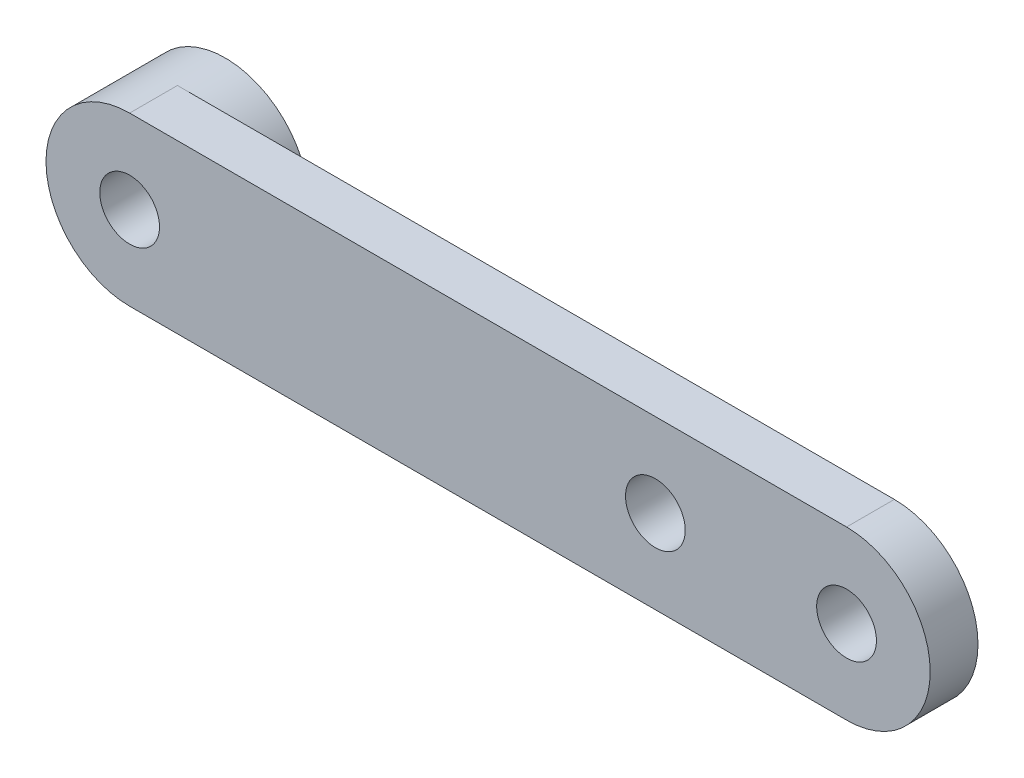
from build123d import *
from build123d.topology import SkipClean

# Parameters (mm, degrees)
EXTRUDE1_DEPTH     = 2.54
SKETCH2_R          = 1.5875
CUT_EXTRUDE3_DEPTH = 75.795345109
EXTRUDE2_START     = 2.54
SKETCH3_R          = 4.445
SKETCH3_R_2        = 1.5875
EXTRUDE2_DEPTH     = 2.54


with BuildPart() as part:
    # Sketch1 → Extrude1 (new body)
    with BuildSketch(Plane.XY):
        with BuildLine():
            Line((-31.75, -8.255), (-69.85, -8.255))
            ThreePointArc((-69.85, -8.255), (-74.295, -3.81), (-69.85, 0.635))
            Line((-69.85, 0.635), (-31.75, 0.635))
            ThreePointArc((-31.75, 0.635), (-27.305, -3.81), (-31.75, -8.255))
        make_face()
    extrude(amount=EXTRUDE1_DEPTH)

    # Sketch2 → Cut-Extrude3 (cut, through all)
    with BuildSketch(Plane.XY):
        with Locations((-31.75, -3.81)):
            Circle(SKETCH2_R)
        with Locations((-41.91, -3.81)):
            Circle(SKETCH2_R)
        with Locations((-69.85, -3.81)):
            Circle(SKETCH2_R)
    extrude(amount=CUT_EXTRUDE3_DEPTH, mode=Mode.SUBTRACT)

    # Sketch3 → Extrude2 (add)
    with SkipClean():  # the faces are left unmerged after this step: merging them gives an invalid solid
        with BuildSketch(Plane(origin=(0, 0, 0), x_dir=(-1, 0, 0), z_dir=(0, 0, -1)).offset(EXTRUDE2_START)):
            with Locations((69.85, -3.81)):
                Circle(SKETCH3_R)
            with Locations((69.85, -3.81)):
                Circle(SKETCH3_R_2, mode=Mode.SUBTRACT)
        extrude(amount=-EXTRUDE2_DEPTH)


solid = part.part
